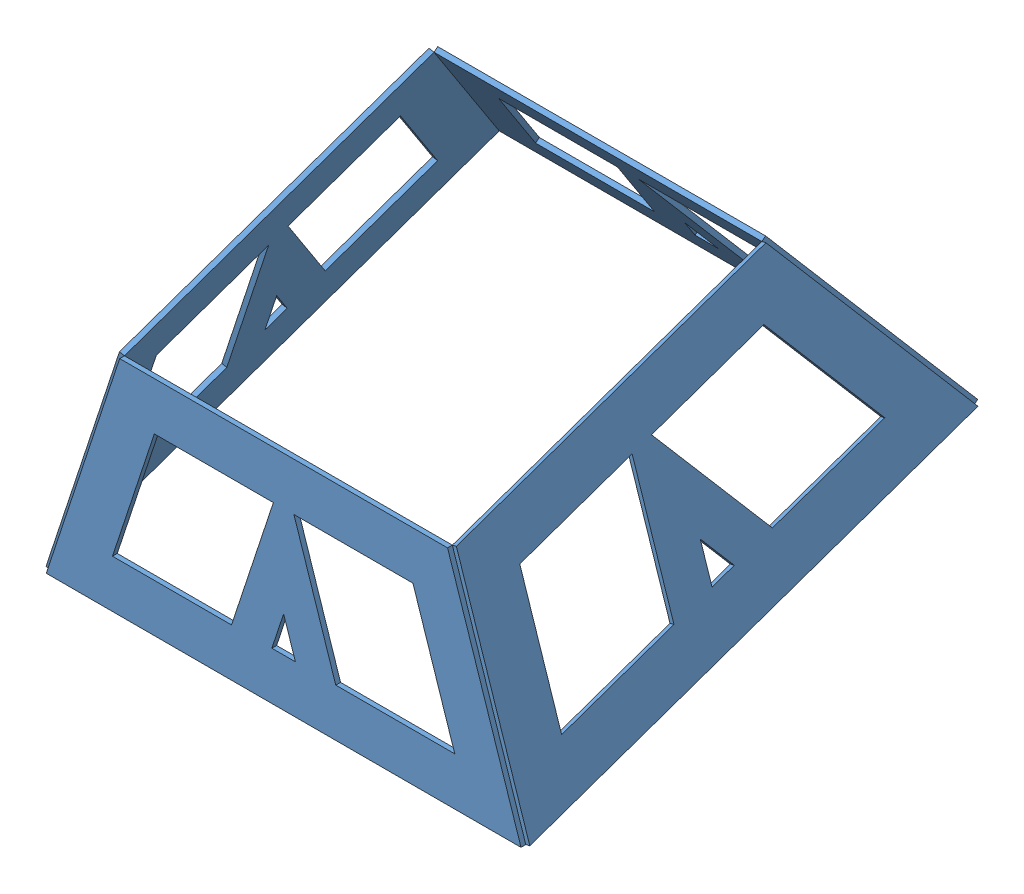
SolidWorks assembly base2-tier1.SLDASM, configuration Default (file format 8000). Lengths in mm.
Overall size (641.44 472.69 691.8).
4 component instances, 1 part files, 7 mates.
Components (placement in the parent):
- Base-2-tier-1: Base-2-tier.SLDPRT [Default] at (399.4513 -22.7257 634.9553) size (629.45 295.21 6.35)
- Base-2-tier-2: Base-2-tier.SLDPRT [Default] at (-58.7885 102.7833 275.7433) x (0 -0.329847 0.944034) z (-0.944034 0.311387 0.108799) size (629.45 295.21 6.35)
- Base-2-tier-3: Base-2-tier.SLDPRT [Default] at (399.4513 257.8869 -161.8191) x (1 0 0) z (0 -0.622773 0.782402) size (629.45 295.21 6.35)
- Base-2-tier-4: Base-2-tier.SLDPRT [Default] at (779.9585 128.4232 202.361) x (0 0.329847 -0.944034) z (0.944034 0.311387 0.108799) size (629.45 295.21 6.35)
Mates (geometry in assembly coordinates):
- Coincident1: coincident aligned: line of Base-2-tier-1 through (675.3081 294.544 634.9553) axis (-0.313246 0.949672 0); line of Base-2-tier-4 through (675.3081 294.544 634.9553) axis (-0.313246 0.949672 0)
- Coincident2: coincident aligned: line of Base-2-tier-1 through (45.8619 294.544 634.9553) axis (0.313246 0.949672 0); line of Base-2-tier-2 through (45.8619 294.544 634.9553) axis (0.313246 0.949672 0)
- Coincident3: coincident aligned: line of Base-2-tier-2 through (45.8619 502.1648 40.7363) axis (0.313246 0.743025 0.59143); line of Base-2-tier-3 through (45.8619 502.1648 40.7363) axis (0.313246 0.743025 0.59143)
- Coincident4: coincident: point of Base-2-tier-1; point of Base-2-tier-2
- Coincident6: coincident: point of Base-2-tier-2; point of Base-2-tier-3
- Coincident8: coincident aligned: line of Base-2-tier-3 through (675.3081 502.1648 40.7363) axis (-0.313246 0.743025 0.59143); line of Base-2-tier-4 through (675.3081 502.1648 40.7363) axis (-0.313246 0.743025 0.59143)
- Perpendicular2: perpendicular: line of Base-2-tier-1 through (45.8619 294.544 634.9553) axis (1 0 0); line of Base-2-tier-4 through (675.3081 294.544 634.9553) axis (0 0.329847 -0.944034)
